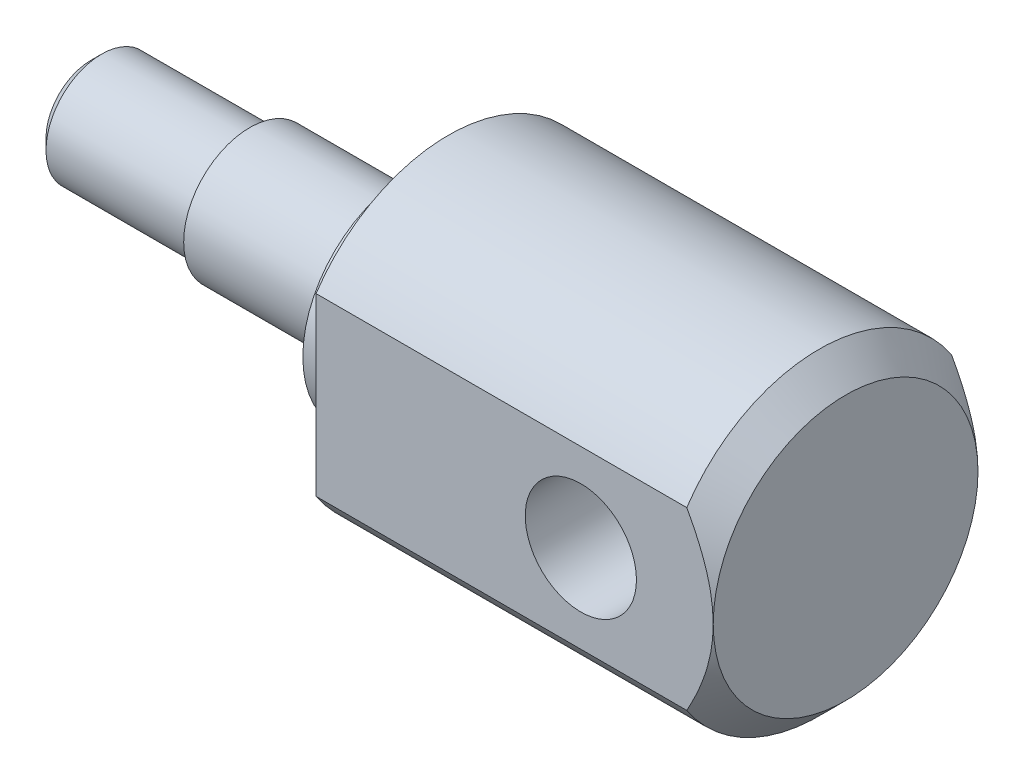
ISO-10303-21;
HEADER;
FILE_DESCRIPTION(('STEP AP214'),'2;1');
FILE_NAME('part.step','',(''),(''),'','','');
FILE_SCHEMA(('AUTOMOTIVE_DESIGN { 1 0 10303 214 1 1 1 1 }'));
ENDSEC;
DATA;
#1=APPLICATION_CONTEXT('core data for automotive mechanical design processes');
#2=APPLICATION_PROTOCOL_DEFINITION('international standard','automotive_design',2000,#1);
#3=PRODUCT_CONTEXT('',#1,'mechanical');
#4=PRODUCT('Part','Part','',(#3));
#5=PRODUCT_RELATED_PRODUCT_CATEGORY('part','',(#4));
#6=PRODUCT_DEFINITION_FORMATION('','',#4);
#7=PRODUCT_DEFINITION_CONTEXT('part definition',#1,'design');
#8=PRODUCT_DEFINITION('design','',#6,#7);
#9=PRODUCT_DEFINITION_SHAPE('','',#8);
#10=(LENGTH_UNIT() NAMED_UNIT(*) SI_UNIT(.MILLI.,.METRE.));
#11=(NAMED_UNIT(*) PLANE_ANGLE_UNIT() SI_UNIT($,.RADIAN.));
#12=(NAMED_UNIT(*) SI_UNIT($,.STERADIAN.) SOLID_ANGLE_UNIT());
#13=UNCERTAINTY_MEASURE_WITH_UNIT(LENGTH_MEASURE(1.E-05),#10,'distance_accuracy_value','');
#14=(GEOMETRIC_REPRESENTATION_CONTEXT(3) GLOBAL_UNCERTAINTY_ASSIGNED_CONTEXT((#13)) GLOBAL_UNIT_ASSIGNED_CONTEXT((#10,
#11,#12)) REPRESENTATION_CONTEXT('',''));
#15=CARTESIAN_POINT('',(0.,0.,0.));
#16=DIRECTION('',(0.,0.,1.));
#17=DIRECTION('',(1.,0.,0.));
#18=AXIS2_PLACEMENT_3D('',#15,#16,#17);
#19=CARTESIAN_POINT('',(10.6956754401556,-10.,5.));
#20=DIRECTION('',(0.,0.,-1.));
#21=DIRECTION('',(-1.,0.,0.));
#22=AXIS2_PLACEMENT_3D('',#19,#20,#21);
#23=PLANE('',#22);
#24=DIRECTION('',(-1.,0.,0.));
#25=VECTOR('',#24,1.);
#26=CARTESIAN_POINT('',(0.,-3.3166247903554,5.));
#27=LINE('',#26,#25);
#28=CARTESIAN_POINT('',(27.5,-3.3166247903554,5.));
#29=VERTEX_POINT('',#28);
#30=CARTESIAN_POINT('',(13.5,-3.3166247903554,5.));
#31=VERTEX_POINT('',#30);
#32=EDGE_CURVE('E93',#29,#31,#27,.T.);
#33=ORIENTED_EDGE('',*,*,#32,.F.);
#34=CARTESIAN_POINT('',(22.4916578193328,-9.80732366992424,5.));
#35=CARTESIAN_POINT('',(22.6930859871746,-9.58119349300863,5.));
#36=CARTESIAN_POINT('',(22.8937491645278,-9.3543754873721,5.));
#37=CARTESIAN_POINT('',(23.2931374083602,-8.89899928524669,5.));
#38=CARTESIAN_POINT('',(23.4918622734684,-8.67044091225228,5.));
#39=CARTESIAN_POINT('',(23.8877531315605,-8.21030230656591,5.));
#40=CARTESIAN_POINT('',(24.0849090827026,-7.97871341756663,5.));
#41=CARTESIAN_POINT('',(24.4761863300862,-7.51300057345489,5.));
#42=CARTESIAN_POINT('',(24.6703077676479,-7.278876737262,5.));
#43=CARTESIAN_POINT('',(25.0662296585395,-6.79333741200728,5.));
#44=CARTESIAN_POINT('',(25.2677921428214,-6.54172718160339,5.));
#45=CARTESIAN_POINT('',(25.6651754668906,-6.03402447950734,5.));
#46=CARTESIAN_POINT('',(25.8609966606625,-5.77793228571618,5.));
#47=CARTESIAN_POINT('',(26.2445617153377,-5.26038239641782,5.));
#48=CARTESIAN_POINT('',(26.4323186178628,-4.99893445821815,5.));
#49=CARTESIAN_POINT('',(26.7057631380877,-4.60117964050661,5.));
#50=CARTESIAN_POINT('',(26.7955352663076,-4.46768156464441,5.));
#51=CARTESIAN_POINT('',(26.9717999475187,-4.1985412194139,5.));
#52=CARTESIAN_POINT('',(27.0582926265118,-4.06289903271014,5.));
#53=CARTESIAN_POINT('',(27.2618405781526,-3.733316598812,5.));
#54=CARTESIAN_POINT('',(27.3769655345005,-3.53817282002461,5.));
#55=CARTESIAN_POINT('',(27.5969963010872,-3.14206624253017,5.));
#56=CARTESIAN_POINT('',(27.7018988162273,-2.94110159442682,5.));
#57=CARTESIAN_POINT('',(27.8972113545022,-2.53432452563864,5.));
#58=CARTESIAN_POINT('',(27.987739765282,-2.32856965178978,5.));
#59=CARTESIAN_POINT('',(28.1510278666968,-1.91010569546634,5.));
#60=CARTESIAN_POINT('',(28.2237994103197,-1.69740135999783,5.));
#61=CARTESIAN_POINT('',(28.3265122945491,-1.33583757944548,5.));
#62=CARTESIAN_POINT('',(28.3626835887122,-1.18875094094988,5.));
#63=CARTESIAN_POINT('',(28.4231066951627,-0.892133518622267,5.));
#64=CARTESIAN_POINT('',(28.447360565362,-0.742603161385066,5.));
#65=CARTESIAN_POINT('',(28.4826598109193,-0.442508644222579,5.));
#66=CARTESIAN_POINT('',(28.4937518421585,-0.29195005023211,5.));
#67=CARTESIAN_POINT('',(28.5022617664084,0.00956074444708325,5.));
#68=CARTESIAN_POINT('',(28.4996796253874,0.160512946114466,5.));
#69=CARTESIAN_POINT('',(28.4810361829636,0.46082123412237,5.));
#70=CARTESIAN_POINT('',(28.4650413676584,0.610181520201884,5.));
#71=CARTESIAN_POINT('',(28.420517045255,0.907029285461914,5.));
#72=CARTESIAN_POINT('',(28.3919845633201,1.05451631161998,5.));
#73=CARTESIAN_POINT('',(28.3233428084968,1.34850138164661,5.));
#74=CARTESIAN_POINT('',(28.2831060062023,1.49496927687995,5.));
#75=CARTESIAN_POINT('',(28.192793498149,1.78477023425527,5.));
#76=CARTESIAN_POINT('',(28.1427196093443,1.92810386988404,5.));
#77=CARTESIAN_POINT('',(28.0163267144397,2.25856233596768,5.));
#78=CARTESIAN_POINT('',(27.9368094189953,2.44445833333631,5.));
#79=CARTESIAN_POINT('',(27.7663146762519,2.8109584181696,5.));
#80=CARTESIAN_POINT('',(27.6753309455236,2.99155953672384,5.));
#81=CARTESIAN_POINT('',(27.4841465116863,3.34862771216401,5.));
#82=CARTESIAN_POINT('',(27.3839133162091,3.52507723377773,5.));
#83=CARTESIAN_POINT('',(27.1765113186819,3.87377641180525,5.));
#84=CARTESIAN_POINT('',(27.0693438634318,4.04602687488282,5.));
#85=CARTESIAN_POINT('',(26.8550187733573,4.37848116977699,5.));
#86=CARTESIAN_POINT('',(26.7481271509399,4.53885738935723,5.));
#87=CARTESIAN_POINT('',(26.5303551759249,4.85688884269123,5.));
#88=CARTESIAN_POINT('',(26.4194745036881,5.01454385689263,5.));
#89=CARTESIAN_POINT('',(26.1954739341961,5.32613837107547,5.));
#90=CARTESIAN_POINT('',(26.0823824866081,5.48009839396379,5.));
#91=CARTESIAN_POINT('',(25.8535863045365,5.78600281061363,5.));
#92=CARTESIAN_POINT('',(25.7378822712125,5.93794772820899,5.));
#93=CARTESIAN_POINT('',(25.6211233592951,6.08906373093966,5.));
#94=B_SPLINE_CURVE_WITH_KNOTS('',3,(#34,#35,#36,#37,#38,#39,#40,#41,#42,#43,#44,#45,#46,#47,#48,
#49,#50,#51,#52,#53,#54,#55,#56,#57,#58,#59,#60,#61,#62,#63,#64,#65,#66,#67,#68,#69,#70,#71,#72,
#73,#74,#75,#76,#77,#78,#79,#80,#81,#82,#83,#84,#85,#86,#87,#88,#89,#90,#91,#92,#93),
.UNSPECIFIED.,.F.,.F.,(4,2,2,2,2,2,2,2,2,2,2,2,2,2,2,2,2,2,2,2,2,2,2,2,2,2,2,2,2,4),(0.,
0.908506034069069,1.81710546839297,2.72951794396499,3.6418878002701,4.60899241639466,
5.57603727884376,6.541454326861,7.02404000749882,7.50660712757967,8.18608499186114,
8.86578115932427,9.53955092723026,10.2128697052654,10.6668587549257,11.1207693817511,
11.5730661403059,12.0253640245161,12.4754330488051,12.9256089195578,13.3808863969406,
13.836079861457,14.4421198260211,15.0484933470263,15.6570845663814,16.2655579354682,
16.8436881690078,17.421864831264,17.9949317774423,18.5678467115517),.UNSPECIFIED.);
#95=CARTESIAN_POINT('',(28.5,0.,5.));
#96=VERTEX_POINT('',#95);
#97=EDGE_CURVE('E11',#29,#96,#94,.T.);
#98=ORIENTED_EDGE('',*,*,#97,.T.);
#99=CARTESIAN_POINT('',(27.5,3.3166247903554,5.));
#100=VERTEX_POINT('',#99);
#101=EDGE_CURVE('E35',#96,#100,#94,.T.);
#102=ORIENTED_EDGE('',*,*,#101,.T.);
#103=DIRECTION('',(-1.,0.,0.));
#104=VECTOR('',#103,1.);
#105=CARTESIAN_POINT('',(0.,3.3166247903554,5.));
#106=LINE('',#105,#104);
#107=CARTESIAN_POINT('',(13.5,3.3166247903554,5.));
#108=VERTEX_POINT('',#107);
#109=EDGE_CURVE('E80',#108,#100,#106,.F.);
#110=ORIENTED_EDGE('',*,*,#109,.F.);
#111=DIRECTION('',(0.,1.,0.));
#112=VECTOR('',#111,1.);
#113=CARTESIAN_POINT('',(13.5,4.,5.));
#114=LINE('',#113,#112);
#115=EDGE_CURVE('E185',#31,#108,#114,.T.);
#116=ORIENTED_EDGE('',*,*,#115,.F.);
#117=EDGE_LOOP('',(#33,#98,#102,#110,#116));
#118=FACE_BOUND('',#117,.T.);
#119=CARTESIAN_POINT('',(23.5,0.,5.));
#120=DIRECTION('',(0.,0.,1.));
#121=DIRECTION('',(1.,0.,0.));
#122=AXIS2_PLACEMENT_3D('',#119,#120,#121);
#123=CIRCLE('',#122,2.09999999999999);
#124=CARTESIAN_POINT('',(25.6,0.,5.));
#125=VERTEX_POINT('',#124);
#126=EDGE_CURVE('E222',#125,#125,#123,.T.);
#127=ORIENTED_EDGE('',*,*,#126,.F.);
#128=EDGE_LOOP('',(#127));
#129=FACE_BOUND('',#128,.T.);
#130=ADVANCED_FACE('F30',(#118,#129),#23,.F.);
#131=CARTESIAN_POINT('',(0.,0.,0.));
#132=DIRECTION('',(-1.,0.,0.));
#133=DIRECTION('',(0.,0.,1.));
#134=AXIS2_PLACEMENT_3D('',#131,#132,#133);
#135=CYLINDRICAL_SURFACE('',#134,6.);
#136=CARTESIAN_POINT('',(27.5,0.,0.));
#137=DIRECTION('',(-1.,0.,0.));
#138=DIRECTION('',(0.,0.,1.));
#139=AXIS2_PLACEMENT_3D('',#136,#137,#138);
#140=CIRCLE('',#139,6.);
#141=CARTESIAN_POINT('',(27.5,-3.3166247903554,-5.));
#142=VERTEX_POINT('',#141);
#143=EDGE_CURVE('E97',#142,#29,#140,.T.);
#144=ORIENTED_EDGE('',*,*,#143,.T.);
#145=ORIENTED_EDGE('',*,*,#32,.T.);
#146=CARTESIAN_POINT('',(13.5,0.,0.));
#147=DIRECTION('',(-1.,0.,0.));
#148=DIRECTION('',(0.,0.,1.));
#149=AXIS2_PLACEMENT_3D('',#146,#147,#148);
#150=CIRCLE('',#149,6.);
#151=CARTESIAN_POINT('',(13.5,-3.3166247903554,-5.));
#152=VERTEX_POINT('',#151);
#153=EDGE_CURVE('E189',#152,#31,#150,.T.);
#154=ORIENTED_EDGE('',*,*,#153,.F.);
#155=DIRECTION('',(-1.,0.,0.));
#156=VECTOR('',#155,1.);
#157=CARTESIAN_POINT('',(0.,-3.3166247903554,-5.));
#158=LINE('',#157,#156);
#159=EDGE_CURVE('E176',#152,#142,#158,.F.);
#160=ORIENTED_EDGE('',*,*,#159,.T.);
#161=EDGE_LOOP('',(#144,#145,#154,#160));
#162=FACE_BOUND('',#161,.T.);
#163=ADVANCED_FACE('F127',(#162),#135,.T.);
#164=CARTESIAN_POINT('',(27.5,0.,0.));
#165=DIRECTION('',(-1.,0.,0.));
#166=DIRECTION('',(0.,0.,1.));
#167=AXIS2_PLACEMENT_3D('',#164,#165,#166);
#168=CONICAL_SURFACE('',#167,6.,0.785398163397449);
#169=ORIENTED_EDGE('',*,*,#97,.F.);
#170=ORIENTED_EDGE('',*,*,#143,.F.);
#171=CARTESIAN_POINT('',(22.4916578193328,-9.80732366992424,-5.));
#172=CARTESIAN_POINT('',(22.6930859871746,-9.58119349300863,-5.));
#173=CARTESIAN_POINT('',(22.8937491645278,-9.3543754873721,-5.));
#174=CARTESIAN_POINT('',(23.2931374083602,-8.89899928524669,-5.));
#175=CARTESIAN_POINT('',(23.4918622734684,-8.67044091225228,-5.));
#176=CARTESIAN_POINT('',(23.8877531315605,-8.21030230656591,-5.));
#177=CARTESIAN_POINT('',(24.0849090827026,-7.97871341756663,-5.));
#178=CARTESIAN_POINT('',(24.4761863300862,-7.51300057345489,-5.));
#179=CARTESIAN_POINT('',(24.6703077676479,-7.278876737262,-5.));
#180=CARTESIAN_POINT('',(25.0662296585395,-6.79333741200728,-5.));
#181=CARTESIAN_POINT('',(25.2677921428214,-6.54172718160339,-5.));
#182=CARTESIAN_POINT('',(25.6651754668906,-6.03402447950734,-5.));
#183=CARTESIAN_POINT('',(25.8609966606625,-5.77793228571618,-5.));
#184=CARTESIAN_POINT('',(26.2445617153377,-5.26038239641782,-5.));
#185=CARTESIAN_POINT('',(26.4323186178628,-4.99893445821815,-5.));
#186=CARTESIAN_POINT('',(26.7057631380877,-4.60117964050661,-5.));
#187=CARTESIAN_POINT('',(26.7955352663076,-4.46768156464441,-5.));
#188=CARTESIAN_POINT('',(26.9717999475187,-4.1985412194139,-5.));
#189=CARTESIAN_POINT('',(27.0582926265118,-4.06289903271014,-5.));
#190=CARTESIAN_POINT('',(27.2618405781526,-3.733316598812,-5.));
#191=CARTESIAN_POINT('',(27.3769655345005,-3.53817282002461,-5.));
#192=CARTESIAN_POINT('',(27.5969963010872,-3.14206624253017,-5.));
#193=CARTESIAN_POINT('',(27.7018988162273,-2.94110159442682,-5.));
#194=CARTESIAN_POINT('',(27.8972113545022,-2.53432452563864,-5.));
#195=CARTESIAN_POINT('',(27.987739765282,-2.32856965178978,-5.));
#196=CARTESIAN_POINT('',(28.1510278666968,-1.91010569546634,-5.));
#197=CARTESIAN_POINT('',(28.2237994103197,-1.69740135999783,-5.));
#198=CARTESIAN_POINT('',(28.3265122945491,-1.33583757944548,-5.));
#199=CARTESIAN_POINT('',(28.3626835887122,-1.18875094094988,-5.));
#200=CARTESIAN_POINT('',(28.4231066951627,-0.892133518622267,-5.));
#201=CARTESIAN_POINT('',(28.447360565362,-0.742603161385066,-5.));
#202=CARTESIAN_POINT('',(28.4826598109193,-0.442508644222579,-5.));
#203=CARTESIAN_POINT('',(28.4937518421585,-0.29195005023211,-5.));
#204=CARTESIAN_POINT('',(28.5022617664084,0.00956074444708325,-5.));
#205=CARTESIAN_POINT('',(28.4996796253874,0.160512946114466,-5.));
#206=CARTESIAN_POINT('',(28.4810361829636,0.46082123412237,-5.));
#207=CARTESIAN_POINT('',(28.4650413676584,0.610181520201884,-5.));
#208=CARTESIAN_POINT('',(28.420517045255,0.907029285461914,-5.));
#209=CARTESIAN_POINT('',(28.3919845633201,1.05451631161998,-5.));
#210=CARTESIAN_POINT('',(28.3233428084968,1.34850138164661,-5.));
#211=CARTESIAN_POINT('',(28.2831060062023,1.49496927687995,-5.));
#212=CARTESIAN_POINT('',(28.192793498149,1.78477023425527,-5.));
#213=CARTESIAN_POINT('',(28.1427196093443,1.92810386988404,-5.));
#214=CARTESIAN_POINT('',(28.0163267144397,2.25856233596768,-5.));
#215=CARTESIAN_POINT('',(27.9368094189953,2.44445833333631,-5.));
#216=CARTESIAN_POINT('',(27.7663146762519,2.8109584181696,-5.));
#217=CARTESIAN_POINT('',(27.6753309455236,2.99155953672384,-5.));
#218=CARTESIAN_POINT('',(27.4841465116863,3.34862771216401,-5.));
#219=CARTESIAN_POINT('',(27.3839133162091,3.52507723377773,-5.));
#220=CARTESIAN_POINT('',(27.1765113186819,3.87377641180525,-5.));
#221=CARTESIAN_POINT('',(27.0693438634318,4.04602687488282,-5.));
#222=CARTESIAN_POINT('',(26.8550187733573,4.37848116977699,-5.));
#223=CARTESIAN_POINT('',(26.7481271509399,4.53885738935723,-5.));
#224=CARTESIAN_POINT('',(26.5303551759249,4.85688884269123,-5.));
#225=CARTESIAN_POINT('',(26.4194745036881,5.01454385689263,-5.));
#226=CARTESIAN_POINT('',(26.1954739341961,5.32613837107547,-5.));
#227=CARTESIAN_POINT('',(26.0823824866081,5.48009839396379,-5.));
#228=CARTESIAN_POINT('',(25.8535863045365,5.78600281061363,-5.));
#229=CARTESIAN_POINT('',(25.7378822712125,5.93794772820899,-5.));
#230=CARTESIAN_POINT('',(25.6211233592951,6.08906373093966,-5.));
#231=B_SPLINE_CURVE_WITH_KNOTS('',3,(#171,#172,#173,#174,#175,#176,#177,#178,#179,#180,#181,
#182,#183,#184,#185,#186,#187,#188,#189,#190,#191,#192,#193,#194,#195,#196,#197,#198,#199,#200,
#201,#202,#203,#204,#205,#206,#207,#208,#209,#210,#211,#212,#213,#214,#215,#216,#217,#218,#219,
#220,#221,#222,#223,#224,#225,#226,#227,#228,#229,#230),.UNSPECIFIED.,.F.,.F.,(4,2,2,2,2,2,2,2,
2,2,2,2,2,2,2,2,2,2,2,2,2,2,2,2,2,2,2,2,2,4),(0.,0.908506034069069,1.81710546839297,
2.72951794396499,3.6418878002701,4.60899241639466,5.57603727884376,6.541454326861,
7.02404000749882,7.50660712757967,8.18608499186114,8.86578115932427,9.53955092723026,
10.2128697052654,10.6668587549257,11.1207693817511,11.5730661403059,12.0253640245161,
12.4754330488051,12.9256089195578,13.3808863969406,13.836079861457,14.4421198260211,
15.0484933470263,15.6570845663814,16.2655579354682,16.8436881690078,17.421864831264,
17.9949317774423,18.5678467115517),.UNSPECIFIED.);
#232=CARTESIAN_POINT('',(28.5,0.,-5.));
#233=VERTEX_POINT('',#232);
#234=EDGE_CURVE('E107',#233,#142,#231,.F.);
#235=ORIENTED_EDGE('',*,*,#234,.F.);
#236=CARTESIAN_POINT('',(28.5,0.,0.));
#237=DIRECTION('',(-1.,0.,0.));
#238=DIRECTION('',(0.,0.,1.));
#239=AXIS2_PLACEMENT_3D('',#236,#237,#238);
#240=CIRCLE('',#239,5.00000000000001);
#241=EDGE_CURVE('E55',#96,#233,#240,.F.);
#242=ORIENTED_EDGE('',*,*,#241,.F.);
#243=EDGE_LOOP('',(#169,#170,#235,#242));
#244=FACE_BOUND('',#243,.T.);
#245=ADVANCED_FACE('F153',(#244),#168,.T.);
#246=CARTESIAN_POINT('',(0.,0.,0.));
#247=DIRECTION('',(1.,0.,0.));
#248=DIRECTION('',(0.,0.,-1.));
#249=AXIS2_PLACEMENT_3D('',#246,#247,#248);
#250=PLANE('',#249);
#251=CARTESIAN_POINT('',(0.,0.,0.));
#252=DIRECTION('',(1.,0.,0.));
#253=DIRECTION('',(0.,0.,-1.));
#254=AXIS2_PLACEMENT_3D('',#251,#252,#253);
#255=CIRCLE('',#254,1.7);
#256=CARTESIAN_POINT('',(0.,0.,-1.7));
#257=VERTEX_POINT('',#256);
#258=EDGE_CURVE('E102',#257,#257,#255,.F.);
#259=ORIENTED_EDGE('',*,*,#258,.T.);
#260=EDGE_LOOP('',(#259));
#261=FACE_BOUND('',#260,.T.);
#262=ADVANCED_FACE('F150',(#261),#250,.F.);
#263=CARTESIAN_POINT('',(0.,0.,0.));
#264=DIRECTION('',(-1.,0.,0.));
#265=DIRECTION('',(0.,0.,1.));
#266=AXIS2_PLACEMENT_3D('',#263,#264,#265);
#267=CYLINDRICAL_SURFACE('',#266,2.1);
#268=CARTESIAN_POINT('',(0.399999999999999,0.,0.));
#269=DIRECTION('',(1.,0.,0.));
#270=DIRECTION('',(0.,0.,-1.));
#271=AXIS2_PLACEMENT_3D('',#268,#269,#270);
#272=CIRCLE('',#271,2.1);
#273=CARTESIAN_POINT('',(0.399999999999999,0.,-2.1));
#274=VERTEX_POINT('',#273);
#275=EDGE_CURVE('E98',#274,#274,#272,.T.);
#276=ORIENTED_EDGE('',*,*,#275,.T.);
#277=EDGE_LOOP('',(#276));
#278=FACE_BOUND('',#277,.T.);
#279=CARTESIAN_POINT('',(6.,0.,0.));
#280=DIRECTION('',(-1.,0.,0.));
#281=DIRECTION('',(0.,0.,1.));
#282=AXIS2_PLACEMENT_3D('',#279,#280,#281);
#283=CIRCLE('',#282,2.1);
#284=CARTESIAN_POINT('',(6.,0.,2.1));
#285=VERTEX_POINT('',#284);
#286=EDGE_CURVE('E203',#285,#285,#283,.T.);
#287=ORIENTED_EDGE('',*,*,#286,.T.);
#288=EDGE_LOOP('',(#287));
#289=FACE_BOUND('',#288,.T.);
#290=ADVANCED_FACE('F146',(#278,#289),#267,.T.);
#291=CARTESIAN_POINT('',(6.,2.1,0.));
#292=DIRECTION('',(1.,0.,0.));
#293=DIRECTION('',(0.,0.,-1.));
#294=AXIS2_PLACEMENT_3D('',#291,#292,#293);
#295=PLANE('',#294);
#296=ORIENTED_EDGE('',*,*,#286,.F.);
#297=EDGE_LOOP('',(#296));
#298=FACE_BOUND('',#297,.T.);
#299=CARTESIAN_POINT('',(6.,0.,0.));
#300=DIRECTION('',(-1.,0.,0.));
#301=DIRECTION('',(0.,0.,1.));
#302=AXIS2_PLACEMENT_3D('',#299,#300,#301);
#303=CIRCLE('',#302,2.5);
#304=CARTESIAN_POINT('',(6.,0.,2.5));
#305=VERTEX_POINT('',#304);
#306=EDGE_CURVE('E200',#305,#305,#303,.T.);
#307=ORIENTED_EDGE('',*,*,#306,.T.);
#308=EDGE_LOOP('',(#307));
#309=FACE_BOUND('',#308,.T.);
#310=ADVANCED_FACE('F142',(#298,#309),#295,.F.);
#311=CARTESIAN_POINT('',(0.,0.,0.));
#312=DIRECTION('',(-1.,0.,0.));
#313=DIRECTION('',(0.,0.,1.));
#314=AXIS2_PLACEMENT_3D('',#311,#312,#313);
#315=CYLINDRICAL_SURFACE('',#314,2.5);
#316=ORIENTED_EDGE('',*,*,#306,.F.);
#317=EDGE_LOOP('',(#316));
#318=FACE_BOUND('',#317,.T.);
#319=CARTESIAN_POINT('',(12.,0.,0.));
#320=DIRECTION('',(-1.,0.,0.));
#321=DIRECTION('',(0.,0.,1.));
#322=AXIS2_PLACEMENT_3D('',#319,#320,#321);
#323=CIRCLE('',#322,2.5);
#324=CARTESIAN_POINT('',(12.,0.,2.5));
#325=VERTEX_POINT('',#324);
#326=EDGE_CURVE('E197',#325,#325,#323,.T.);
#327=ORIENTED_EDGE('',*,*,#326,.T.);
#328=EDGE_LOOP('',(#327));
#329=FACE_BOUND('',#328,.T.);
#330=ADVANCED_FACE('F138',(#318,#329),#315,.T.);
#331=CARTESIAN_POINT('',(12.,2.5,0.));
#332=DIRECTION('',(1.,0.,0.));
#333=DIRECTION('',(0.,0.,-1.));
#334=AXIS2_PLACEMENT_3D('',#331,#332,#333);
#335=PLANE('',#334);
#336=ORIENTED_EDGE('',*,*,#326,.F.);
#337=EDGE_LOOP('',(#336));
#338=FACE_BOUND('',#337,.T.);
#339=CARTESIAN_POINT('',(12.,0.,0.));
#340=DIRECTION('',(-1.,0.,0.));
#341=DIRECTION('',(0.,0.,1.));
#342=AXIS2_PLACEMENT_3D('',#339,#340,#341);
#343=CIRCLE('',#342,4.);
#344=CARTESIAN_POINT('',(12.,0.,4.));
#345=VERTEX_POINT('',#344);
#346=EDGE_CURVE('E194',#345,#345,#343,.T.);
#347=ORIENTED_EDGE('',*,*,#346,.T.);
#348=EDGE_LOOP('',(#347));
#349=FACE_BOUND('',#348,.T.);
#350=ADVANCED_FACE('F134',(#338,#349),#335,.F.);
#351=CARTESIAN_POINT('',(0.,0.,0.));
#352=DIRECTION('',(-1.,0.,0.));
#353=DIRECTION('',(0.,0.,1.));
#354=AXIS2_PLACEMENT_3D('',#351,#352,#353);
#355=CYLINDRICAL_SURFACE('',#354,4.);
#356=ORIENTED_EDGE('',*,*,#346,.F.);
#357=EDGE_LOOP('',(#356));
#358=FACE_BOUND('',#357,.T.);
#359=CARTESIAN_POINT('',(13.5,0.,0.));
#360=DIRECTION('',(-1.,0.,0.));
#361=DIRECTION('',(0.,0.,1.));
#362=AXIS2_PLACEMENT_3D('',#359,#360,#361);
#363=CIRCLE('',#362,4.);
#364=CARTESIAN_POINT('',(13.5,0.,4.));
#365=VERTEX_POINT('',#364);
#366=EDGE_CURVE('E191',#365,#365,#363,.T.);
#367=ORIENTED_EDGE('',*,*,#366,.T.);
#368=EDGE_LOOP('',(#367));
#369=FACE_BOUND('',#368,.T.);
#370=ADVANCED_FACE('F130',(#358,#369),#355,.T.);
#371=CARTESIAN_POINT('',(13.5,4.,0.));
#372=DIRECTION('',(1.,0.,0.));
#373=DIRECTION('',(0.,0.,-1.));
#374=AXIS2_PLACEMENT_3D('',#371,#372,#373);
#375=PLANE('',#374);
#376=ORIENTED_EDGE('',*,*,#366,.F.);
#377=EDGE_LOOP('',(#376));
#378=FACE_BOUND('',#377,.T.);
#379=ORIENTED_EDGE('',*,*,#153,.T.);
#380=ORIENTED_EDGE('',*,*,#115,.T.);
#381=CARTESIAN_POINT('',(13.5,3.3166247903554,-5.));
#382=VERTEX_POINT('',#381);
#383=EDGE_CURVE('E92',#108,#382,#150,.T.);
#384=ORIENTED_EDGE('',*,*,#383,.T.);
#385=DIRECTION('',(0.,-1.,0.));
#386=VECTOR('',#385,1.);
#387=CARTESIAN_POINT('',(13.5,4.,-5.));
#388=LINE('',#387,#386);
#389=EDGE_CURVE('E182',#382,#152,#388,.T.);
#390=ORIENTED_EDGE('',*,*,#389,.T.);
#391=EDGE_LOOP('',(#379,#380,#384,#390));
#392=FACE_BOUND('',#391,.T.);
#393=ADVANCED_FACE('F126',(#378,#392),#375,.F.);
#394=ORIENTED_EDGE('',*,*,#383,.F.);
#395=ORIENTED_EDGE('',*,*,#109,.T.);
#396=CARTESIAN_POINT('',(27.5,3.3166247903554,-5.));
#397=VERTEX_POINT('',#396);
#398=EDGE_CURVE('E90',#100,#397,#140,.T.);
#399=ORIENTED_EDGE('',*,*,#398,.T.);
#400=DIRECTION('',(-1.,0.,0.));
#401=VECTOR('',#400,1.);
#402=CARTESIAN_POINT('',(0.,3.3166247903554,-5.));
#403=LINE('',#402,#401);
#404=EDGE_CURVE('E181',#397,#382,#403,.T.);
#405=ORIENTED_EDGE('',*,*,#404,.T.);
#406=EDGE_LOOP('',(#394,#395,#399,#405));
#407=FACE_BOUND('',#406,.T.);
#408=ADVANCED_FACE('F88',(#407),#135,.T.);
#409=CARTESIAN_POINT('',(28.5,6.,0.));
#410=DIRECTION('',(-1.,0.,0.));
#411=DIRECTION('',(0.,0.,1.));
#412=AXIS2_PLACEMENT_3D('',#409,#410,#411);
#413=PLANE('',#412);
#414=EDGE_CURVE('E106',#233,#96,#240,.F.);
#415=ORIENTED_EDGE('',*,*,#414,.T.);
#416=ORIENTED_EDGE('',*,*,#241,.T.);
#417=EDGE_LOOP('',(#415,#416));
#418=FACE_BOUND('',#417,.T.);
#419=ADVANCED_FACE('F120',(#418),#413,.F.);
#420=CARTESIAN_POINT('',(0.,0.,0.));
#421=DIRECTION('',(1.,0.,0.));
#422=DIRECTION('',(0.,0.,-1.));
#423=AXIS2_PLACEMENT_3D('',#420,#421,#422);
#424=CONICAL_SURFACE('',#423,1.7,0.785398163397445);
#425=CARTESIAN_POINT('',(0.399999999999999,0.,-2.1));
#426=CARTESIAN_POINT('',(0.395833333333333,0.,-2.09583333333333));
#427=CARTESIAN_POINT('',(0.391666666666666,0.,-2.09166666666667));
#428=CARTESIAN_POINT('',(0.383333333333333,0.,-2.08333333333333));
#429=CARTESIAN_POINT('',(0.379166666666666,0.,-2.07916666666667));
#430=CARTESIAN_POINT('',(0.370833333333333,0.,-2.07083333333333));
#431=CARTESIAN_POINT('',(0.366666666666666,0.,-2.06666666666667));
#432=CARTESIAN_POINT('',(0.358333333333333,0.,-2.05833333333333));
#433=CARTESIAN_POINT('',(0.354166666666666,0.,-2.05416666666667));
#434=CARTESIAN_POINT('',(0.345833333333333,0.,-2.04583333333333));
#435=CARTESIAN_POINT('',(0.341666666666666,0.,-2.04166666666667));
#436=CARTESIAN_POINT('',(0.333333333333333,0.,-2.03333333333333));
#437=CARTESIAN_POINT('',(0.329166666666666,0.,-2.02916666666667));
#438=CARTESIAN_POINT('',(0.320833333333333,0.,-2.02083333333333));
#439=CARTESIAN_POINT('',(0.316666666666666,0.,-2.01666666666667));
#440=CARTESIAN_POINT('',(0.308333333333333,0.,-2.00833333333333));
#441=CARTESIAN_POINT('',(0.304166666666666,0.,-2.00416666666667));
#442=CARTESIAN_POINT('',(0.295833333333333,0.,-1.99583333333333));
#443=CARTESIAN_POINT('',(0.291666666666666,0.,-1.99166666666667));
#444=CARTESIAN_POINT('',(0.283333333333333,0.,-1.98333333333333));
#445=CARTESIAN_POINT('',(0.279166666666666,0.,-1.97916666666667));
#446=CARTESIAN_POINT('',(0.270833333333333,0.,-1.97083333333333));
#447=CARTESIAN_POINT('',(0.266666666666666,0.,-1.96666666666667));
#448=CARTESIAN_POINT('',(0.258333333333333,0.,-1.95833333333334));
#449=CARTESIAN_POINT('',(0.254166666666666,0.,-1.95416666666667));
#450=CARTESIAN_POINT('',(0.245833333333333,0.,-1.94583333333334));
#451=CARTESIAN_POINT('',(0.241666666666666,0.,-1.94166666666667));
#452=CARTESIAN_POINT('',(0.233333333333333,0.,-1.93333333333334));
#453=CARTESIAN_POINT('',(0.229166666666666,0.,-1.92916666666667));
#454=CARTESIAN_POINT('',(0.220833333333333,0.,-1.92083333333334));
#455=CARTESIAN_POINT('',(0.216666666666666,0.,-1.91666666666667));
#456=CARTESIAN_POINT('',(0.208333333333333,0.,-1.90833333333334));
#457=CARTESIAN_POINT('',(0.204166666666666,0.,-1.90416666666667));
#458=CARTESIAN_POINT('',(0.195833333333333,0.,-1.89583333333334));
#459=CARTESIAN_POINT('',(0.191666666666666,0.,-1.89166666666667));
#460=CARTESIAN_POINT('',(0.183333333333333,0.,-1.88333333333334));
#461=CARTESIAN_POINT('',(0.179166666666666,0.,-1.87916666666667));
#462=CARTESIAN_POINT('',(0.170833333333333,0.,-1.87083333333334));
#463=CARTESIAN_POINT('',(0.166666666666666,0.,-1.86666666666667));
#464=CARTESIAN_POINT('',(0.158333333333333,0.,-1.85833333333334));
#465=CARTESIAN_POINT('',(0.154166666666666,0.,-1.85416666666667));
#466=CARTESIAN_POINT('',(0.145833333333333,0.,-1.84583333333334));
#467=CARTESIAN_POINT('',(0.141666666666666,0.,-1.84166666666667));
#468=CARTESIAN_POINT('',(0.133333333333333,0.,-1.83333333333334));
#469=CARTESIAN_POINT('',(0.129166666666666,0.,-1.82916666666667));
#470=CARTESIAN_POINT('',(0.120833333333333,0.,-1.82083333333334));
#471=CARTESIAN_POINT('',(0.116666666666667,0.,-1.81666666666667));
#472=CARTESIAN_POINT('',(0.108333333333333,0.,-1.80833333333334));
#473=CARTESIAN_POINT('',(0.104166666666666,0.,-1.80416666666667));
#474=CARTESIAN_POINT('',(0.0958333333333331,0.,-1.79583333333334));
#475=CARTESIAN_POINT('',(0.0916666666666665,0.,-1.79166666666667));
#476=CARTESIAN_POINT('',(0.0833333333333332,0.,-1.78333333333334));
#477=CARTESIAN_POINT('',(0.0791666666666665,0.,-1.77916666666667));
#478=CARTESIAN_POINT('',(0.0708333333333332,0.,-1.77083333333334));
#479=CARTESIAN_POINT('',(0.0666666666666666,0.,-1.76666666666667));
#480=CARTESIAN_POINT('',(0.0583333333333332,0.,-1.75833333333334));
#481=CARTESIAN_POINT('',(0.0541666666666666,0.,-1.75416666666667));
#482=CARTESIAN_POINT('',(0.0458333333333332,0.,-1.74583333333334));
#483=CARTESIAN_POINT('',(0.0416666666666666,0.,-1.74166666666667));
#484=CARTESIAN_POINT('',(0.0333333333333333,0.,-1.73333333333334));
#485=CARTESIAN_POINT('',(0.0291666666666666,0.,-1.72916666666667));
#486=CARTESIAN_POINT('',(0.0208333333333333,0.,-1.72083333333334));
#487=CARTESIAN_POINT('',(0.0166666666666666,0.,-1.71666666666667));
#488=CARTESIAN_POINT('',(0.00833333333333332,0.,-1.70833333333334));
#489=CARTESIAN_POINT('',(0.00416666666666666,0.,-1.70416666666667));
#490=CARTESIAN_POINT('',(0.,0.,-1.7));
#491=B_SPLINE_CURVE_WITH_KNOTS('',3,(#425,#426,#427,#428,#429,#430,#431,#432,#433,#434,#435,
#436,#437,#438,#439,#440,#441,#442,#443,#444,#445,#446,#447,#448,#449,#450,#451,#452,#453,#454,
#455,#456,#457,#458,#459,#460,#461,#462,#463,#464,#465,#466,#467,#468,#469,#470,#471,#472,#473,
#474,#475,#476,#477,#478,#479,#480,#481,#482,#483,#484,#485,#486,#487,#488,#489,#490),
.UNSPECIFIED.,.F.,.F.,(4,2,2,2,2,2,2,2,2,2,2,2,2,2,2,2,2,2,2,2,2,2,2,2,2,2,2,2,2,2,2,2,4),(0.,
0.0176776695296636,0.0353553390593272,0.0530330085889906,0.0707106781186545,0.0883883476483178,
0.106066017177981,0.123743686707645,0.141421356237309,0.159099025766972,0.176776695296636,
0.1944543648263,0.212132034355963,0.229809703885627,0.24748737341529,0.265165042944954,
0.282842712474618,0.300520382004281,0.318198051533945,0.335875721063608,0.353553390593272,
0.371231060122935,0.388908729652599,0.406586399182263,0.424264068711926,0.44194173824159,
0.459619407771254,0.477297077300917,0.494974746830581,0.512652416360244,0.530330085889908,
0.548007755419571,0.565685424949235),.UNSPECIFIED.);
#492=EDGE_CURVE('BSEAM123',#274,#257,#491,.T.);
#493=ORIENTED_EDGE('',*,*,#275,.F.);
#494=ORIENTED_EDGE('',*,*,#258,.F.);
#495=ORIENTED_EDGE('',*,*,#492,.T.);
#496=ORIENTED_EDGE('',*,*,#492,.F.);
#497=EDGE_LOOP('',(#493,#495,#494,#496));
#498=FACE_BOUND('',#497,.T.);
#499=ADVANCED_FACE('F123',(#498),#424,.T.);
#500=ORIENTED_EDGE('',*,*,#101,.F.);
#501=ORIENTED_EDGE('',*,*,#414,.F.);
#502=EDGE_CURVE('E85',#397,#233,#231,.F.);
#503=ORIENTED_EDGE('',*,*,#502,.F.);
#504=ORIENTED_EDGE('',*,*,#398,.F.);
#505=EDGE_LOOP('',(#500,#501,#503,#504));
#506=FACE_BOUND('',#505,.T.);
#507=ADVANCED_FACE('F32',(#506),#168,.T.);
#508=CARTESIAN_POINT('',(10.6956754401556,-10.,-5.));
#509=DIRECTION('',(0.,0.,1.));
#510=DIRECTION('',(1.,0.,0.));
#511=AXIS2_PLACEMENT_3D('',#508,#509,#510);
#512=PLANE('',#511);
#513=CARTESIAN_POINT('',(23.5,0.,-5.00000000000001));
#514=DIRECTION('',(0.,0.,1.));
#515=DIRECTION('',(1.,0.,0.));
#516=AXIS2_PLACEMENT_3D('',#513,#514,#515);
#517=CIRCLE('',#516,2.1);
#518=CARTESIAN_POINT('',(25.6,0.,-5.00000000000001));
#519=VERTEX_POINT('',#518);
#520=EDGE_CURVE('E94',#519,#519,#517,.T.);
#521=ORIENTED_EDGE('',*,*,#520,.T.);
#522=EDGE_LOOP('',(#521));
#523=FACE_BOUND('',#522,.T.);
#524=ORIENTED_EDGE('',*,*,#404,.F.);
#525=ORIENTED_EDGE('',*,*,#502,.T.);
#526=ORIENTED_EDGE('',*,*,#234,.T.);
#527=ORIENTED_EDGE('',*,*,#159,.F.);
#528=ORIENTED_EDGE('',*,*,#389,.F.);
#529=EDGE_LOOP('',(#524,#525,#526,#527,#528));
#530=FACE_BOUND('',#529,.T.);
#531=ADVANCED_FACE('F112',(#523,#530),#512,.F.);
#532=CARTESIAN_POINT('',(23.5,0.,5.));
#533=DIRECTION('',(0.,0.,1.));
#534=DIRECTION('',(1.,0.,0.));
#535=AXIS2_PLACEMENT_3D('',#532,#533,#534);
#536=CYLINDRICAL_SURFACE('',#535,2.09999999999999);
#537=ORIENTED_EDGE('',*,*,#520,.F.);
#538=EDGE_LOOP('',(#537));
#539=FACE_BOUND('',#538,.T.);
#540=ORIENTED_EDGE('',*,*,#126,.T.);
#541=EDGE_LOOP('',(#540));
#542=FACE_BOUND('',#541,.T.);
#543=ADVANCED_FACE('F116',(#539,#542),#536,.F.);
#544=CLOSED_SHELL('',(#130,#163,#245,#262,#290,#310,#330,#350,#370,#393,#408,#419,#499,#507,
#531,#543));
#545=MANIFOLD_SOLID_BREP('B2',#544);
#546=ADVANCED_BREP_SHAPE_REPRESENTATION('',(#18,#545),#14);
#547=SHAPE_DEFINITION_REPRESENTATION(#9,#546);
ENDSEC;
END-ISO-10303-21;
